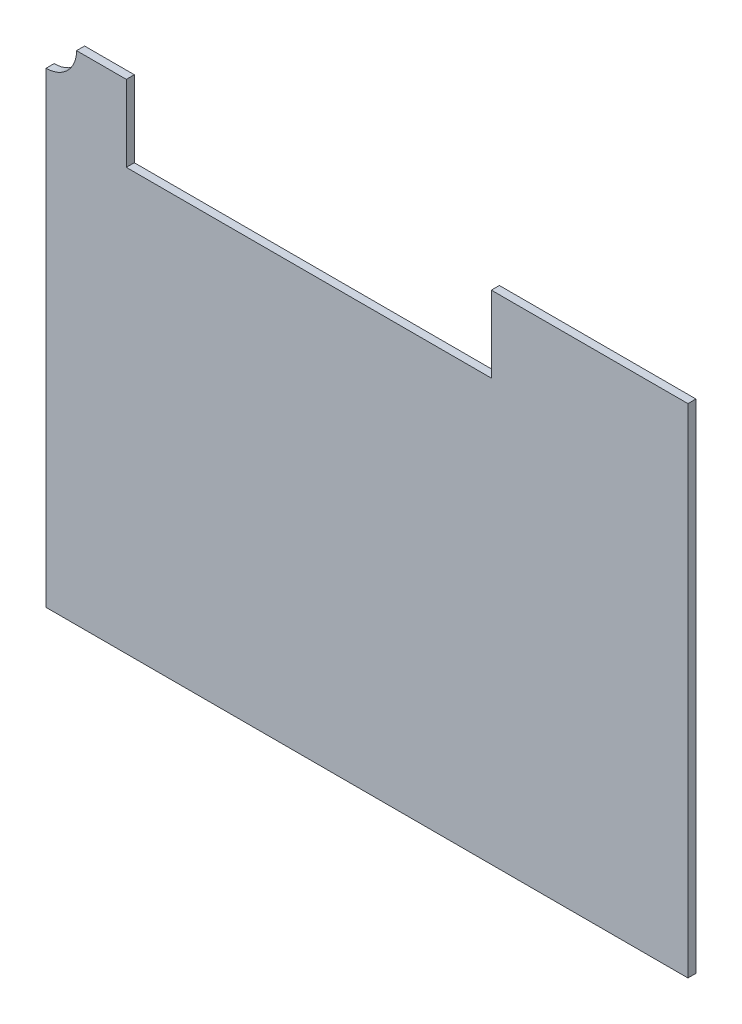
from build123d import *

# Parameters (mm, degrees)
EXTRUSION1_DEPTH        = 1
ENL_V_MAT_EXTRU_1_DEPTH = 1


with BuildPart() as part:
    # Esquisse1 → Extrusion1 (new body)
    with BuildSketch(Plane.XY):
        Polygon((-54.260289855, -17.255507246), (25.739710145, -17.255507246), (25.739710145, 44.744492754), (1.239710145, 44.744492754), (1.239710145, 35.244492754), (-44.260289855, 35.244492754), (-44.260289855, 44.744492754), (-54.260289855, 44.744492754), align=None)
    extrude(amount=EXTRUSION1_DEPTH)

    # Esquisse2 → Enl_v. mat.-Extru.1 (cut)
    with BuildSketch(Plane.XY.offset(1)):
        with BuildLine():
            Line((-54.260289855, 44.744492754), (-54.260289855, 40.941802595))
            ThreePointArc((-54.260289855, 40.941802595), (-51.571381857, 42.055584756), (-50.457599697, 44.744492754))
            Line((-50.457599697, 44.744492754), (-54.260289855, 44.744492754))
        make_face()
    extrude(amount=-ENL_V_MAT_EXTRU_1_DEPTH, mode=Mode.SUBTRACT)


solid = part.part
